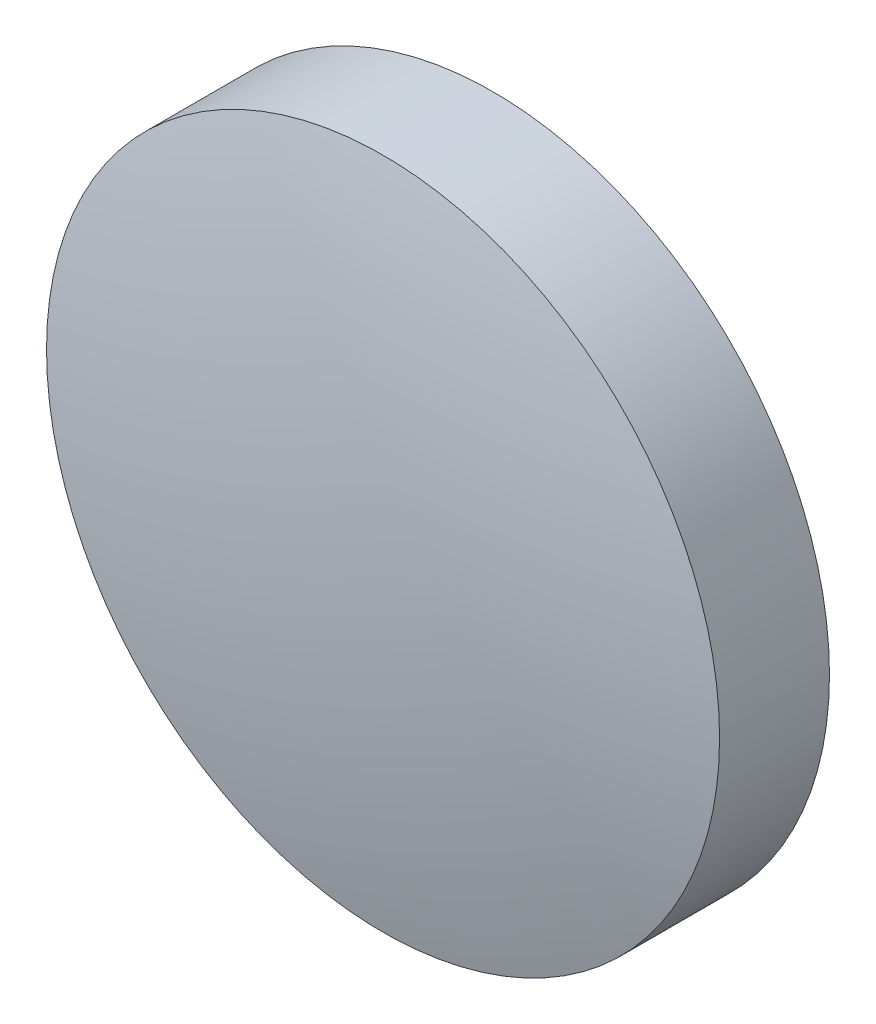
ISO-10303-21;
HEADER;
FILE_DESCRIPTION(('STEP AP214'),'2;1');
FILE_NAME('part.step','',(''),(''),'','','');
FILE_SCHEMA(('AUTOMOTIVE_DESIGN { 1 0 10303 214 1 1 1 1 }'));
ENDSEC;
DATA;
#1=APPLICATION_CONTEXT('core data for automotive mechanical design processes');
#2=APPLICATION_PROTOCOL_DEFINITION('international standard','automotive_design',2000,#1);
#3=PRODUCT_CONTEXT('',#1,'mechanical');
#4=PRODUCT('Part','Part','',(#3));
#5=PRODUCT_RELATED_PRODUCT_CATEGORY('part','',(#4));
#6=PRODUCT_DEFINITION_FORMATION('','',#4);
#7=PRODUCT_DEFINITION_CONTEXT('part definition',#1,'design');
#8=PRODUCT_DEFINITION('design','',#6,#7);
#9=PRODUCT_DEFINITION_SHAPE('','',#8);
#10=(LENGTH_UNIT() NAMED_UNIT(*) SI_UNIT(.MILLI.,.METRE.));
#11=(NAMED_UNIT(*) PLANE_ANGLE_UNIT() SI_UNIT($,.RADIAN.));
#12=(NAMED_UNIT(*) SI_UNIT($,.STERADIAN.) SOLID_ANGLE_UNIT());
#13=UNCERTAINTY_MEASURE_WITH_UNIT(LENGTH_MEASURE(1.E-05),#10,'distance_accuracy_value','');
#14=(GEOMETRIC_REPRESENTATION_CONTEXT(3) GLOBAL_UNCERTAINTY_ASSIGNED_CONTEXT((#13)) GLOBAL_UNIT_ASSIGNED_CONTEXT((#10,
#11,#12)) REPRESENTATION_CONTEXT('',''));
#15=CARTESIAN_POINT('',(0.,0.,0.));
#16=DIRECTION('',(0.,0.,1.));
#17=DIRECTION('',(1.,0.,0.));
#18=AXIS2_PLACEMENT_3D('',#15,#16,#17);
#19=CARTESIAN_POINT('',(0.,0.,5.552));
#20=DIRECTION('',(0.,0.,-1.));
#21=DIRECTION('',(-1.,0.,0.));
#22=AXIS2_PLACEMENT_3D('',#19,#20,#21);
#23=CYLINDRICAL_SURFACE('',#22,17.);
#24=CARTESIAN_POINT('',(0.,0.,5.552));
#25=DIRECTION('',(0.,0.,1.));
#26=DIRECTION('',(1.,0.,0.));
#27=AXIS2_PLACEMENT_3D('',#24,#25,#26);
#28=CIRCLE('',#27,17.);
#29=CARTESIAN_POINT('',(-17.,0.,5.552));
#30=VERTEX_POINT('',#29);
#31=EDGE_CURVE('E10',#30,#30,#28,.T.);
#32=CARTESIAN_POINT('',(0.,0.,0.));
#33=DIRECTION('',(0.,0.,1.));
#34=DIRECTION('',(1.,0.,0.));
#35=AXIS2_PLACEMENT_3D('',#32,#33,#34);
#36=CIRCLE('',#35,17.);
#37=CARTESIAN_POINT('',(-17.,0.,0.));
#38=VERTEX_POINT('',#37);
#39=EDGE_CURVE('E38',#38,#38,#36,.T.);
#40=CARTESIAN_POINT('',(-17.,0.,5.552));
#41=CARTESIAN_POINT('',(-17.,0.,5.49416666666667));
#42=CARTESIAN_POINT('',(-17.,0.,5.43633333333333));
#43=CARTESIAN_POINT('',(-17.,0.,5.32066666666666));
#44=CARTESIAN_POINT('',(-17.,0.,5.26283333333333));
#45=CARTESIAN_POINT('',(-17.,0.,5.14716666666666));
#46=CARTESIAN_POINT('',(-17.,0.,5.08933333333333));
#47=CARTESIAN_POINT('',(-17.,0.,4.97366666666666));
#48=CARTESIAN_POINT('',(-17.,0.,4.91583333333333));
#49=CARTESIAN_POINT('',(-17.,0.,4.80016666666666));
#50=CARTESIAN_POINT('',(-17.,0.,4.74233333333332));
#51=CARTESIAN_POINT('',(-17.,0.,4.62666666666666));
#52=CARTESIAN_POINT('',(-17.,0.,4.56883333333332));
#53=CARTESIAN_POINT('',(-17.,0.,4.45316666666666));
#54=CARTESIAN_POINT('',(-17.,0.,4.39533333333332));
#55=CARTESIAN_POINT('',(-17.,0.,4.27966666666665));
#56=CARTESIAN_POINT('',(-17.,0.,4.22183333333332));
#57=CARTESIAN_POINT('',(-17.,0.,4.10616666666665));
#58=CARTESIAN_POINT('',(-17.,0.,4.04833333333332));
#59=CARTESIAN_POINT('',(-17.,0.,3.93266666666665));
#60=CARTESIAN_POINT('',(-17.,0.,3.87483333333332));
#61=CARTESIAN_POINT('',(-17.,0.,3.75916666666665));
#62=CARTESIAN_POINT('',(-17.,0.,3.70133333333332));
#63=CARTESIAN_POINT('',(-17.,0.,3.58566666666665));
#64=CARTESIAN_POINT('',(-17.,0.,3.52783333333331));
#65=CARTESIAN_POINT('',(-17.,0.,3.41216666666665));
#66=CARTESIAN_POINT('',(-17.,0.,3.35433333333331));
#67=CARTESIAN_POINT('',(-17.,0.,3.23866666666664));
#68=CARTESIAN_POINT('',(-17.,0.,3.18083333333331));
#69=CARTESIAN_POINT('',(-17.,0.,3.06516666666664));
#70=CARTESIAN_POINT('',(-17.,0.,3.00733333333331));
#71=CARTESIAN_POINT('',(-17.,0.,2.89166666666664));
#72=CARTESIAN_POINT('',(-17.,0.,2.83383333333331));
#73=CARTESIAN_POINT('',(-17.,0.,2.71816666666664));
#74=CARTESIAN_POINT('',(-17.,0.,2.66033333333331));
#75=CARTESIAN_POINT('',(-17.,0.,2.54466666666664));
#76=CARTESIAN_POINT('',(-17.,0.,2.4868333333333));
#77=CARTESIAN_POINT('',(-17.,0.,2.37116666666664));
#78=CARTESIAN_POINT('',(-17.,0.,2.3133333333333));
#79=CARTESIAN_POINT('',(-17.,0.,2.19766666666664));
#80=CARTESIAN_POINT('',(-17.,0.,2.1398333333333));
#81=CARTESIAN_POINT('',(-17.,0.,2.02416666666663));
#82=CARTESIAN_POINT('',(-17.,0.,1.9663333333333));
#83=CARTESIAN_POINT('',(-17.,0.,1.85066666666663));
#84=CARTESIAN_POINT('',(-17.,0.,1.7928333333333));
#85=CARTESIAN_POINT('',(-17.,0.,1.67716666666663));
#86=CARTESIAN_POINT('',(-17.,0.,1.6193333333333));
#87=CARTESIAN_POINT('',(-17.,0.,1.50366666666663));
#88=CARTESIAN_POINT('',(-17.,0.,1.4458333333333));
#89=CARTESIAN_POINT('',(-17.,0.,1.33016666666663));
#90=CARTESIAN_POINT('',(-17.,0.,1.27233333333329));
#91=CARTESIAN_POINT('',(-17.,0.,1.15666666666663));
#92=CARTESIAN_POINT('',(-17.,0.,1.09883333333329));
#93=CARTESIAN_POINT('',(-17.,0.,0.983166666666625));
#94=CARTESIAN_POINT('',(-17.,0.,0.925333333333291));
#95=CARTESIAN_POINT('',(-17.,0.,0.809666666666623));
#96=CARTESIAN_POINT('',(-17.,0.,0.751833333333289));
#97=CARTESIAN_POINT('',(-17.,0.,0.636166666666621));
#98=CARTESIAN_POINT('',(-17.,0.,0.578333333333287));
#99=CARTESIAN_POINT('',(-17.,0.,0.46266666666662));
#100=CARTESIAN_POINT('',(-17.,0.,0.404833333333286));
#101=CARTESIAN_POINT('',(-17.,0.,0.289166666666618));
#102=CARTESIAN_POINT('',(-17.,0.,0.231333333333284));
#103=CARTESIAN_POINT('',(-17.,0.,0.115666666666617));
#104=CARTESIAN_POINT('',(-17.,0.,0.0578333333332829));
#105=CARTESIAN_POINT('',(-17.,0.,0.));
#106=B_SPLINE_CURVE_WITH_KNOTS('',3,(#40,#41,#42,#43,#44,#45,#46,#47,#48,#49,#50,#51,#52,#53,
#54,#55,#56,#57,#58,#59,#60,#61,#62,#63,#64,#65,#66,#67,#68,#69,#70,#71,#72,#73,#74,#75,#76,#77,
#78,#79,#80,#81,#82,#83,#84,#85,#86,#87,#88,#89,#90,#91,#92,#93,#94,#95,#96,#97,#98,#99,#100,
#101,#102,#103,#104,#105),.UNSPECIFIED.,.F.,.F.,(4,2,2,2,2,2,2,2,2,2,2,2,2,2,2,2,2,2,2,2,2,2,2,
2,2,2,2,2,2,2,2,2,4),(0.,0.173500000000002,0.347000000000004,0.520500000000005,
0.694000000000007,0.867500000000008,1.04100000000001,1.21450000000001,1.38800000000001,
1.56150000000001,1.73500000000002,1.90850000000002,2.08200000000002,2.25550000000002,
2.42900000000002,2.60250000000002,2.77600000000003,2.94950000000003,3.12300000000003,
3.29650000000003,3.47000000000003,3.64350000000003,3.81700000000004,3.99050000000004,
4.16400000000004,4.33750000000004,4.51100000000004,4.68450000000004,4.85800000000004,
5.03150000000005,5.20500000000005,5.37850000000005,5.55200000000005),.UNSPECIFIED.);
#107=EDGE_CURVE('BSEAM32',#30,#38,#106,.T.);
#108=ORIENTED_EDGE('',*,*,#31,.F.);
#109=ORIENTED_EDGE('',*,*,#39,.T.);
#110=ORIENTED_EDGE('',*,*,#107,.T.);
#111=ORIENTED_EDGE('',*,*,#107,.F.);
#112=EDGE_LOOP('',(#108,#110,#109,#111));
#113=FACE_BOUND('',#112,.T.);
#114=ADVANCED_FACE('F32',(#113),#23,.T.);
#115=CARTESIAN_POINT('',(0.,0.,57.3525305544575));
#116=DIRECTION('',(0.,0.,1.));
#117=DIRECTION('',(1.,0.,0.));
#118=AXIS2_PLACEMENT_3D('',#115,#116,#117);
#119=SPHERICAL_SURFACE('',#118,59.8189999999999);
#120=ORIENTED_EDGE('',*,*,#39,.F.);
#121=EDGE_LOOP('',(#120));
#122=FACE_BOUND('',#121,.T.);
#123=ADVANCED_FACE('F45',(#122),#119,.T.);
#124=CARTESIAN_POINT('',(0.,0.,-67.3480736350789));
#125=DIRECTION('',(0.,0.,-1.));
#126=DIRECTION('',(1.,0.,0.));
#127=AXIS2_PLACEMENT_3D('',#124,#125,#126);
#128=SPHERICAL_SURFACE('',#127,74.8559999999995);
#129=ORIENTED_EDGE('',*,*,#31,.T.);
#130=EDGE_LOOP('',(#129));
#131=FACE_BOUND('',#130,.T.);
#132=ADVANCED_FACE('F47',(#131),#128,.T.);
#133=CLOSED_SHELL('',(#114,#123,#132));
#134=MANIFOLD_SOLID_BREP('B2',#133);
#135=ADVANCED_BREP_SHAPE_REPRESENTATION('',(#18,#134),#14);
#136=SHAPE_DEFINITION_REPRESENTATION(#9,#135);
ENDSEC;
END-ISO-10303-21;
